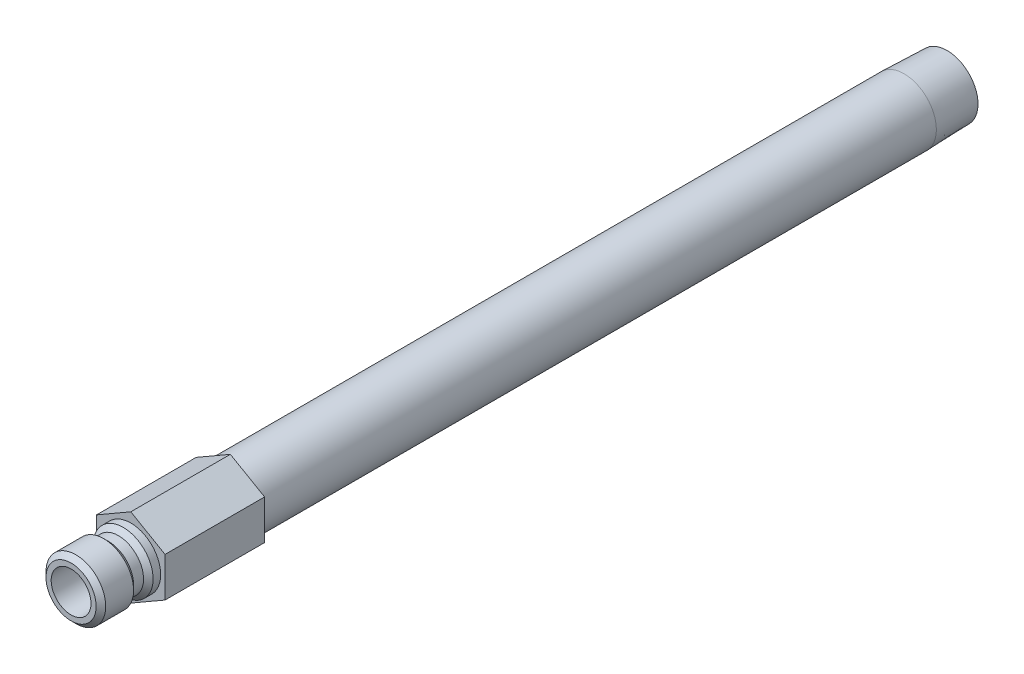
from build123d import *

# Parameters (mm, degrees)
SKETCH2_R           = 2.38125
BOSS_EXTRUDE1_DEPTH = 15.875


with BuildPart() as part:
    # Sketch1 → Revolve1 (revolve)
    with BuildSketch(Plane(origin=(0, 0, 0), x_dir=(0, 0, -1), z_dir=(1, 0, 0))):
        Polygon((-9.525, 3.175), (-9.525, 4.0005), (-8.763, 4.7625), (-4.318, 4.7625), (-3.556, 4.0005), (-1.9685, 4.0005), (-1.2065, 4.7625), (0, 4.7625), (0, 5.1435), (123.317, 5.1435), (130.175, 4.929188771), (130.175, 2.38125), (0.127, 2.38125), (0.127, 3.175), align=None)
    revolve(axis=Axis((0, 0, 0), (0, 0, 1)))

    # Sketch2 → Boss-Extrude1 (add)
    with BuildSketch(Plane.XY):
        Polygon((-5.461, 3.15290982), (-5.461, -3.15290982), (0, -6.30581964), (5.461, -3.15290982), (5.461, 3.15290982), (0, 6.30581964), align=None)
        with Locations(Location((0, 0, 0), (0, 0, 90))):
            Circle(SKETCH2_R, mode=Mode.SUBTRACT)
    extrude(amount=-BOSS_EXTRUDE1_DEPTH)


solid = part.part
